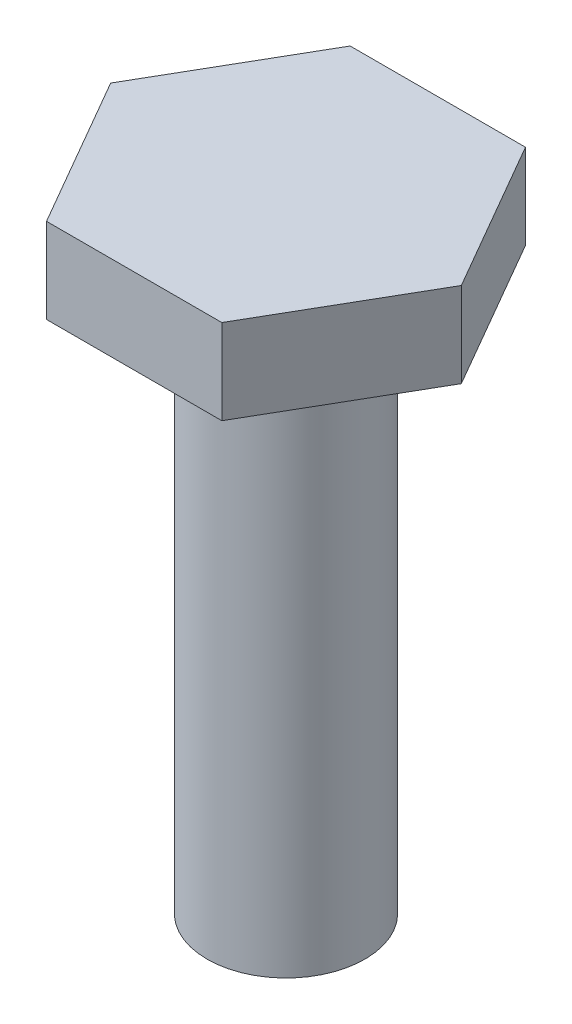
from build123d import *

# Parameters (mm, degrees)
SKETCH2_R           = 1.651
BOSS_EXTRUDE1_DEPTH = 11.43
BOSS_EXTRUDE2_DEPTH = 1.778


with BuildPart() as part:
    # Sketch2 → Boss-Extrude1 (new body)
    with BuildSketch(Plane(origin=(0, 0, 0), x_dir=(1, 0, 0), z_dir=(0, 1, 0))):
        with Locations(Location((0, 0, 0), (0, 0, 270))):
            Circle(SKETCH2_R)
    extrude(amount=BOSS_EXTRUDE1_DEPTH)

    # Sketch3 → Boss-Extrude2 (add)
    with BuildSketch(Plane(origin=(0, 11.43, 0), x_dir=(1, 0, 0), z_dir=(0, 1, 0))):
        Polygon((3.666174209, 0), (1.833087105, 3.175), (-1.833087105, 3.175), (-3.666174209, 0), (-1.833087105, -3.175), (1.833087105, -3.175), align=None)
    extrude(amount=BOSS_EXTRUDE2_DEPTH)


solid = part.part
